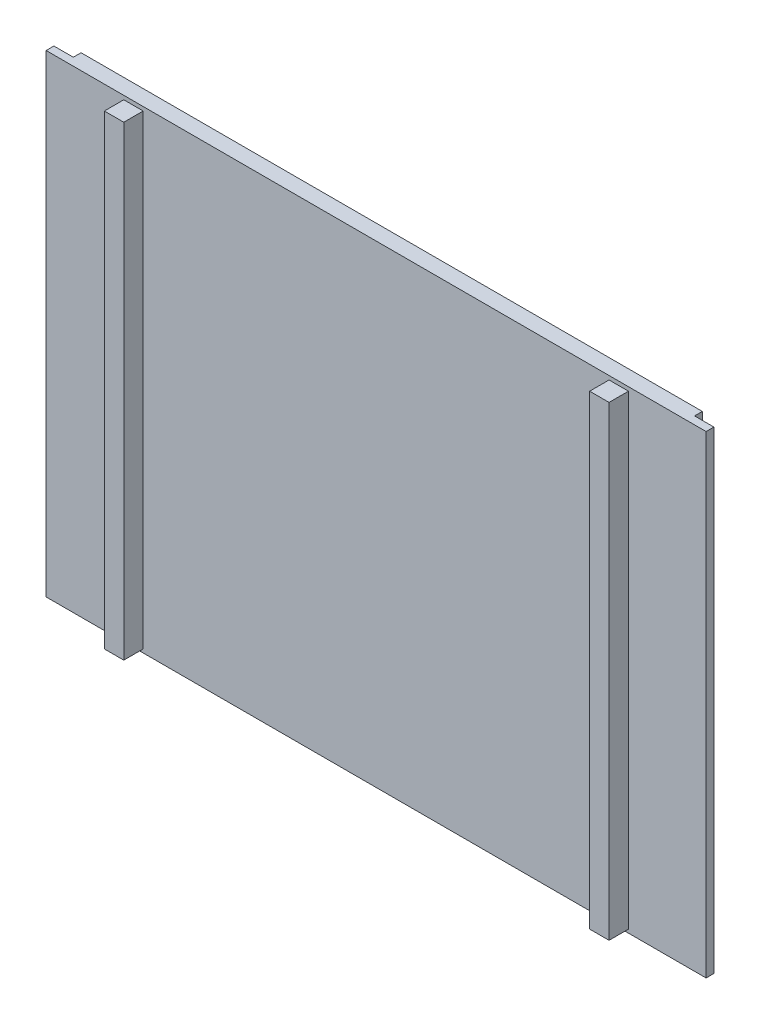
ISO-10303-21;
HEADER;
FILE_DESCRIPTION(('STEP AP214'),'2;1');
FILE_NAME('part.step','',(''),(''),'','','');
FILE_SCHEMA(('AUTOMOTIVE_DESIGN { 1 0 10303 214 1 1 1 1 }'));
ENDSEC;
DATA;
#1=APPLICATION_CONTEXT('core data for automotive mechanical design processes');
#2=APPLICATION_PROTOCOL_DEFINITION('international standard','automotive_design',2000,#1);
#3=PRODUCT_CONTEXT('',#1,'mechanical');
#4=PRODUCT('Part','Part','',(#3));
#5=PRODUCT_RELATED_PRODUCT_CATEGORY('part','',(#4));
#6=PRODUCT_DEFINITION_FORMATION('','',#4);
#7=PRODUCT_DEFINITION_CONTEXT('part definition',#1,'design');
#8=PRODUCT_DEFINITION('design','',#6,#7);
#9=PRODUCT_DEFINITION_SHAPE('','',#8);
#10=(LENGTH_UNIT() NAMED_UNIT(*) SI_UNIT(.MILLI.,.METRE.));
#11=(NAMED_UNIT(*) PLANE_ANGLE_UNIT() SI_UNIT($,.RADIAN.));
#12=(NAMED_UNIT(*) SI_UNIT($,.STERADIAN.) SOLID_ANGLE_UNIT());
#13=UNCERTAINTY_MEASURE_WITH_UNIT(LENGTH_MEASURE(1.E-05),#10,'distance_accuracy_value','');
#14=(GEOMETRIC_REPRESENTATION_CONTEXT(3) GLOBAL_UNCERTAINTY_ASSIGNED_CONTEXT((#13)) GLOBAL_UNIT_ASSIGNED_CONTEXT((#10,
#11,#12)) REPRESENTATION_CONTEXT('',''));
#15=CARTESIAN_POINT('',(0.,0.,0.));
#16=DIRECTION('',(0.,0.,1.));
#17=DIRECTION('',(1.,0.,0.));
#18=AXIS2_PLACEMENT_3D('',#15,#16,#17);
#19=CARTESIAN_POINT('',(0.,0.,10.));
#20=DIRECTION('',(0.,0.,-1.));
#21=DIRECTION('',(-1.,0.,0.));
#22=AXIS2_PLACEMENT_3D('',#19,#20,#21);
#23=PLANE('',#22);
#24=DIRECTION('',(0.,-1.,0.));
#25=VECTOR('',#24,1.);
#26=CARTESIAN_POINT('',(100.,604.5,10.));
#27=LINE('',#26,#25);
#28=CARTESIAN_POINT('',(100.,604.5,10.));
#29=VERTEX_POINT('',#28);
#30=CARTESIAN_POINT('',(100.,4.50000000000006,10.));
#31=VERTEX_POINT('',#30);
#32=EDGE_CURVE('E201',#29,#31,#27,.T.);
#33=ORIENTED_EDGE('',*,*,#32,.F.);
#34=DIRECTION('',(-1.,0.,0.));
#35=VECTOR('',#34,1.);
#36=CARTESIAN_POINT('',(100.,604.5,10.));
#37=LINE('',#36,#35);
#38=CARTESIAN_POINT('',(125.,604.5,10.));
#39=VERTEX_POINT('',#38);
#40=EDGE_CURVE('E217',#39,#29,#37,.T.);
#41=ORIENTED_EDGE('',*,*,#40,.F.);
#42=DIRECTION('',(0.,1.,0.));
#43=VECTOR('',#42,1.);
#44=CARTESIAN_POINT('',(125.,604.5,10.));
#45=LINE('',#44,#43);
#46=CARTESIAN_POINT('',(125.,4.50000000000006,10.));
#47=VERTEX_POINT('',#46);
#48=EDGE_CURVE('E230',#47,#39,#45,.T.);
#49=ORIENTED_EDGE('',*,*,#48,.F.);
#50=DIRECTION('',(1.,0.,0.));
#51=VECTOR('',#50,1.);
#52=CARTESIAN_POINT('',(100.,4.50000000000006,10.));
#53=LINE('',#52,#51);
#54=EDGE_CURVE('E206',#31,#47,#53,.T.);
#55=ORIENTED_EDGE('',*,*,#54,.F.);
#56=EDGE_LOOP('',(#33,#41,#49,#55));
#57=FACE_BOUND('',#56,.T.);
#58=DIRECTION('',(0.,-1.,0.));
#59=VECTOR('',#58,1.);
#60=CARTESIAN_POINT('',(0.,0.,10.));
#61=LINE('',#60,#59);
#62=CARTESIAN_POINT('',(0.,609.5,10.));
#63=VERTEX_POINT('',#62);
#64=CARTESIAN_POINT('',(0.,0.,10.));
#65=VERTEX_POINT('',#64);
#66=EDGE_CURVE('E338',#63,#65,#61,.T.);
#67=ORIENTED_EDGE('',*,*,#66,.T.);
#68=DIRECTION('',(1.,0.,0.));
#69=VECTOR('',#68,1.);
#70=CARTESIAN_POINT('',(0.,0.,10.));
#71=LINE('',#70,#69);
#72=CARTESIAN_POINT('',(850.,0.,10.));
#73=VERTEX_POINT('',#72);
#74=EDGE_CURVE('E342',#65,#73,#71,.T.);
#75=ORIENTED_EDGE('',*,*,#74,.T.);
#76=DIRECTION('',(0.,1.,0.));
#77=VECTOR('',#76,1.);
#78=CARTESIAN_POINT('',(850.,0.,10.));
#79=LINE('',#78,#77);
#80=CARTESIAN_POINT('',(850.,609.5,10.));
#81=VERTEX_POINT('',#80);
#82=EDGE_CURVE('E346',#73,#81,#79,.T.);
#83=ORIENTED_EDGE('',*,*,#82,.T.);
#84=DIRECTION('',(-1.,0.,0.));
#85=VECTOR('',#84,1.);
#86=CARTESIAN_POINT('',(0.,609.5,10.));
#87=LINE('',#86,#85);
#88=EDGE_CURVE('E349',#81,#63,#87,.T.);
#89=ORIENTED_EDGE('',*,*,#88,.T.);
#90=EDGE_LOOP('',(#67,#75,#83,#89));
#91=FACE_BOUND('',#90,.T.);
#92=DIRECTION('',(0.,-1.,0.));
#93=VECTOR('',#92,1.);
#94=CARTESIAN_POINT('',(725.,604.5,10.));
#95=LINE('',#94,#93);
#96=CARTESIAN_POINT('',(725.,604.5,10.));
#97=VERTEX_POINT('',#96);
#98=CARTESIAN_POINT('',(725.,4.50000000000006,10.));
#99=VERTEX_POINT('',#98);
#100=EDGE_CURVE('E199',#97,#99,#95,.T.);
#101=ORIENTED_EDGE('',*,*,#100,.F.);
#102=DIRECTION('',(-1.,0.,0.));
#103=VECTOR('',#102,1.);
#104=CARTESIAN_POINT('',(725.,604.5,10.));
#105=LINE('',#104,#103);
#106=CARTESIAN_POINT('',(750.,604.5,10.));
#107=VERTEX_POINT('',#106);
#108=EDGE_CURVE('E196',#107,#97,#105,.T.);
#109=ORIENTED_EDGE('',*,*,#108,.F.);
#110=DIRECTION('',(0.,1.,0.));
#111=VECTOR('',#110,1.);
#112=CARTESIAN_POINT('',(750.,604.5,10.));
#113=LINE('',#112,#111);
#114=CARTESIAN_POINT('',(750.,4.50000000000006,10.));
#115=VERTEX_POINT('',#114);
#116=EDGE_CURVE('E60',#115,#107,#113,.T.);
#117=ORIENTED_EDGE('',*,*,#116,.F.);
#118=DIRECTION('',(1.,0.,0.));
#119=VECTOR('',#118,1.);
#120=CARTESIAN_POINT('',(725.,4.50000000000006,10.));
#121=LINE('',#120,#119);
#122=EDGE_CURVE('E55',#99,#115,#121,.T.);
#123=ORIENTED_EDGE('',*,*,#122,.F.);
#124=EDGE_LOOP('',(#101,#109,#117,#123));
#125=FACE_BOUND('',#124,.T.);
#126=ADVANCED_FACE('F39',(#57,#91,#125),#23,.F.);
#127=CARTESIAN_POINT('',(0.,0.,10.));
#128=DIRECTION('',(1.,0.,0.));
#129=DIRECTION('',(0.,0.,-1.));
#130=AXIS2_PLACEMENT_3D('',#127,#128,#129);
#131=PLANE('',#130);
#132=DIRECTION('',(0.,-1.,0.));
#133=VECTOR('',#132,1.);
#134=CARTESIAN_POINT('',(0.,0.,0.));
#135=LINE('',#134,#133);
#136=CARTESIAN_POINT('',(0.,609.5,0.));
#137=VERTEX_POINT('',#136);
#138=CARTESIAN_POINT('',(0.,0.,0.));
#139=VERTEX_POINT('',#138);
#140=EDGE_CURVE('E337',#137,#139,#135,.T.);
#141=ORIENTED_EDGE('',*,*,#140,.T.);
#142=DIRECTION('',(0.,0.,-1.));
#143=VECTOR('',#142,1.);
#144=CARTESIAN_POINT('',(0.,0.,10.));
#145=LINE('',#144,#143);
#146=EDGE_CURVE('E11',#65,#139,#145,.T.);
#147=ORIENTED_EDGE('',*,*,#146,.F.);
#148=ORIENTED_EDGE('',*,*,#66,.F.);
#149=DIRECTION('',(0.,0.,-1.));
#150=VECTOR('',#149,1.);
#151=CARTESIAN_POINT('',(0.,609.5,10.));
#152=LINE('',#151,#150);
#153=EDGE_CURVE('E352',#63,#137,#152,.T.);
#154=ORIENTED_EDGE('',*,*,#153,.T.);
#155=EDGE_LOOP('',(#141,#147,#148,#154));
#156=FACE_BOUND('',#155,.T.);
#157=ADVANCED_FACE('F41',(#156),#131,.F.);
#158=CARTESIAN_POINT('',(0.,0.,10.));
#159=DIRECTION('',(0.,1.,0.));
#160=DIRECTION('',(0.,0.,1.));
#161=AXIS2_PLACEMENT_3D('',#158,#159,#160);
#162=PLANE('',#161);
#163=DIRECTION('',(1.,0.,0.));
#164=VECTOR('',#163,1.);
#165=CARTESIAN_POINT('',(0.,0.,0.));
#166=LINE('',#165,#164);
#167=CARTESIAN_POINT('',(850.,0.,0.));
#168=VERTEX_POINT('',#167);
#169=EDGE_CURVE('E356',#139,#168,#166,.T.);
#170=ORIENTED_EDGE('',*,*,#169,.T.);
#171=DIRECTION('',(0.,0.,-1.));
#172=VECTOR('',#171,1.);
#173=CARTESIAN_POINT('',(850.,0.,10.));
#174=LINE('',#173,#172);
#175=EDGE_CURVE('E48',#73,#168,#174,.T.);
#176=ORIENTED_EDGE('',*,*,#175,.F.);
#177=ORIENTED_EDGE('',*,*,#74,.F.);
#178=ORIENTED_EDGE('',*,*,#146,.T.);
#179=EDGE_LOOP('',(#170,#176,#177,#178));
#180=FACE_BOUND('',#179,.T.);
#181=ADVANCED_FACE('F420',(#180),#162,.F.);
#182=CARTESIAN_POINT('',(850.,0.,10.));
#183=DIRECTION('',(-1.,0.,0.));
#184=DIRECTION('',(0.,0.,1.));
#185=AXIS2_PLACEMENT_3D('',#182,#183,#184);
#186=PLANE('',#185);
#187=DIRECTION('',(0.,1.,0.));
#188=VECTOR('',#187,1.);
#189=CARTESIAN_POINT('',(850.,0.,0.));
#190=LINE('',#189,#188);
#191=CARTESIAN_POINT('',(850.,609.5,0.));
#192=VERTEX_POINT('',#191);
#193=EDGE_CURVE('E359',#168,#192,#190,.T.);
#194=ORIENTED_EDGE('',*,*,#193,.T.);
#195=DIRECTION('',(0.,0.,-1.));
#196=VECTOR('',#195,1.);
#197=CARTESIAN_POINT('',(850.,609.5,10.));
#198=LINE('',#197,#196);
#199=EDGE_CURVE('E369',#81,#192,#198,.T.);
#200=ORIENTED_EDGE('',*,*,#199,.F.);
#201=ORIENTED_EDGE('',*,*,#82,.F.);
#202=ORIENTED_EDGE('',*,*,#175,.T.);
#203=EDGE_LOOP('',(#194,#200,#201,#202));
#204=FACE_BOUND('',#203,.T.);
#205=ADVANCED_FACE('F378',(#204),#186,.F.);
#206=CARTESIAN_POINT('',(0.,609.5,10.));
#207=DIRECTION('',(0.,-1.,0.));
#208=DIRECTION('',(0.,0.,-1.));
#209=AXIS2_PLACEMENT_3D('',#206,#207,#208);
#210=PLANE('',#209);
#211=DIRECTION('',(-1.,0.,0.));
#212=VECTOR('',#211,1.);
#213=CARTESIAN_POINT('',(0.,609.5,0.));
#214=LINE('',#213,#212);
#215=CARTESIAN_POINT('',(825.16,609.5,0.));
#216=VERTEX_POINT('',#215);
#217=EDGE_CURVE('E343',#192,#216,#214,.T.);
#218=ORIENTED_EDGE('',*,*,#217,.T.);
#219=DIRECTION('',(0.,0.,1.));
#220=VECTOR('',#219,1.);
#221=CARTESIAN_POINT('',(825.16,609.5,-10.));
#222=LINE('',#221,#220);
#223=CARTESIAN_POINT('',(825.16,609.5,-10.));
#224=VERTEX_POINT('',#223);
#225=EDGE_CURVE('E311',#224,#216,#222,.T.);
#226=ORIENTED_EDGE('',*,*,#225,.F.);
#227=DIRECTION('',(1.,0.,0.));
#228=VECTOR('',#227,1.);
#229=CARTESIAN_POINT('',(825.16,609.5,-10.));
#230=LINE('',#229,#228);
#231=CARTESIAN_POINT('',(25.,609.5,-10.));
#232=VERTEX_POINT('',#231);
#233=EDGE_CURVE('E308',#232,#224,#230,.T.);
#234=ORIENTED_EDGE('',*,*,#233,.F.);
#235=DIRECTION('',(0.,0.,1.));
#236=VECTOR('',#235,1.);
#237=CARTESIAN_POINT('',(25.,609.5,-10.));
#238=LINE('',#237,#236);
#239=CARTESIAN_POINT('',(25.,609.5,0.));
#240=VERTEX_POINT('',#239);
#241=EDGE_CURVE('E325',#232,#240,#238,.T.);
#242=ORIENTED_EDGE('',*,*,#241,.T.);
#243=EDGE_CURVE('E362',#240,#137,#214,.T.);
#244=ORIENTED_EDGE('',*,*,#243,.T.);
#245=ORIENTED_EDGE('',*,*,#153,.F.);
#246=ORIENTED_EDGE('',*,*,#88,.F.);
#247=ORIENTED_EDGE('',*,*,#199,.T.);
#248=EDGE_LOOP('',(#218,#226,#234,#242,#244,#245,#246,#247));
#249=FACE_BOUND('',#248,.T.);
#250=ADVANCED_FACE('F387',(#249),#210,.F.);
#251=CARTESIAN_POINT('',(0.,0.,0.));
#252=DIRECTION('',(0.,0.,-1.));
#253=DIRECTION('',(-1.,0.,0.));
#254=AXIS2_PLACEMENT_3D('',#251,#252,#253);
#255=PLANE('',#254);
#256=DIRECTION('',(0.,-1.,0.));
#257=VECTOR('',#256,1.);
#258=CARTESIAN_POINT('',(825.16,4.99000000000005,0.));
#259=LINE('',#258,#257);
#260=CARTESIAN_POINT('',(825.16,4.99000000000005,0.));
#261=VERTEX_POINT('',#260);
#262=EDGE_CURVE('E296',#216,#261,#259,.T.);
#263=ORIENTED_EDGE('',*,*,#262,.F.);
#264=ORIENTED_EDGE('',*,*,#217,.F.);
#265=ORIENTED_EDGE('',*,*,#193,.F.);
#266=ORIENTED_EDGE('',*,*,#169,.F.);
#267=ORIENTED_EDGE('',*,*,#140,.F.);
#268=ORIENTED_EDGE('',*,*,#243,.F.);
#269=DIRECTION('',(0.,1.,0.));
#270=VECTOR('',#269,1.);
#271=CARTESIAN_POINT('',(25.,4.99000000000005,0.));
#272=LINE('',#271,#270);
#273=CARTESIAN_POINT('',(25.,4.99000000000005,0.));
#274=VERTEX_POINT('',#273);
#275=EDGE_CURVE('E302',#274,#240,#272,.T.);
#276=ORIENTED_EDGE('',*,*,#275,.F.);
#277=DIRECTION('',(-1.,0.,0.));
#278=VECTOR('',#277,1.);
#279=CARTESIAN_POINT('',(825.16,4.99000000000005,0.));
#280=LINE('',#279,#278);
#281=EDGE_CURVE('E315',#261,#274,#280,.T.);
#282=ORIENTED_EDGE('',*,*,#281,.F.);
#283=EDGE_LOOP('',(#263,#264,#265,#266,#267,#268,#276,#282));
#284=FACE_BOUND('',#283,.T.);
#285=ADVANCED_FACE('F383',(#284),#255,.T.);
#286=CARTESIAN_POINT('',(0.,0.,-10.));
#287=DIRECTION('',(0.,0.,1.));
#288=DIRECTION('',(1.,0.,0.));
#289=AXIS2_PLACEMENT_3D('',#286,#287,#288);
#290=PLANE('',#289);
#291=DIRECTION('',(0.,-1.,0.));
#292=VECTOR('',#291,1.);
#293=CARTESIAN_POINT('',(825.16,4.99000000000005,-10.));
#294=LINE('',#293,#292);
#295=CARTESIAN_POINT('',(825.16,4.99000000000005,-10.));
#296=VERTEX_POINT('',#295);
#297=EDGE_CURVE('E297',#224,#296,#294,.T.);
#298=ORIENTED_EDGE('',*,*,#297,.T.);
#299=DIRECTION('',(-1.,0.,0.));
#300=VECTOR('',#299,1.);
#301=CARTESIAN_POINT('',(825.16,4.99000000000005,-10.));
#302=LINE('',#301,#300);
#303=CARTESIAN_POINT('',(25.,4.99000000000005,-10.));
#304=VERTEX_POINT('',#303);
#305=EDGE_CURVE('E301',#296,#304,#302,.T.);
#306=ORIENTED_EDGE('',*,*,#305,.T.);
#307=DIRECTION('',(0.,1.,0.));
#308=VECTOR('',#307,1.);
#309=CARTESIAN_POINT('',(25.,4.99000000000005,-10.));
#310=LINE('',#309,#308);
#311=EDGE_CURVE('E305',#304,#232,#310,.T.);
#312=ORIENTED_EDGE('',*,*,#311,.T.);
#313=ORIENTED_EDGE('',*,*,#233,.T.);
#314=EDGE_LOOP('',(#298,#306,#312,#313));
#315=FACE_BOUND('',#314,.T.);
#316=DIRECTION('',(0.,-1.,0.));
#317=VECTOR('',#316,1.);
#318=CARTESIAN_POINT('',(820.16,9.99000000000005,-10.));
#319=LINE('',#318,#317);
#320=CARTESIAN_POINT('',(820.16,604.5,-10.));
#321=VERTEX_POINT('',#320);
#322=CARTESIAN_POINT('',(820.16,9.99000000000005,-10.));
#323=VERTEX_POINT('',#322);
#324=EDGE_CURVE('E253',#321,#323,#319,.T.);
#325=ORIENTED_EDGE('',*,*,#324,.F.);
#326=DIRECTION('',(1.,0.,0.));
#327=VECTOR('',#326,1.);
#328=CARTESIAN_POINT('',(820.16,604.5,-10.));
#329=LINE('',#328,#327);
#330=CARTESIAN_POINT('',(30.,604.5,-10.));
#331=VERTEX_POINT('',#330);
#332=EDGE_CURVE('E264',#331,#321,#329,.T.);
#333=ORIENTED_EDGE('',*,*,#332,.F.);
#334=DIRECTION('',(0.,1.,0.));
#335=VECTOR('',#334,1.);
#336=CARTESIAN_POINT('',(30.,9.99000000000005,-10.));
#337=LINE('',#336,#335);
#338=CARTESIAN_POINT('',(30.,9.99000000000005,-10.));
#339=VERTEX_POINT('',#338);
#340=EDGE_CURVE('E260',#339,#331,#337,.T.);
#341=ORIENTED_EDGE('',*,*,#340,.F.);
#342=DIRECTION('',(-1.,0.,0.));
#343=VECTOR('',#342,1.);
#344=CARTESIAN_POINT('',(820.16,9.99000000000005,-10.));
#345=LINE('',#344,#343);
#346=EDGE_CURVE('E256',#323,#339,#345,.T.);
#347=ORIENTED_EDGE('',*,*,#346,.F.);
#348=EDGE_LOOP('',(#325,#333,#341,#347));
#349=FACE_BOUND('',#348,.T.);
#350=ADVANCED_FACE('F395',(#315,#349),#290,.F.);
#351=CARTESIAN_POINT('',(825.16,4.99000000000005,-10.));
#352=DIRECTION('',(-1.,0.,0.));
#353=DIRECTION('',(0.,0.,1.));
#354=AXIS2_PLACEMENT_3D('',#351,#352,#353);
#355=PLANE('',#354);
#356=ORIENTED_EDGE('',*,*,#262,.T.);
#357=DIRECTION('',(0.,0.,1.));
#358=VECTOR('',#357,1.);
#359=CARTESIAN_POINT('',(825.16,4.99000000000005,-10.));
#360=LINE('',#359,#358);
#361=EDGE_CURVE('E333',#296,#261,#360,.T.);
#362=ORIENTED_EDGE('',*,*,#361,.F.);
#363=ORIENTED_EDGE('',*,*,#297,.F.);
#364=ORIENTED_EDGE('',*,*,#225,.T.);
#365=EDGE_LOOP('',(#356,#362,#363,#364));
#366=FACE_BOUND('',#365,.T.);
#367=ADVANCED_FACE('F392',(#366),#355,.F.);
#368=CARTESIAN_POINT('',(825.16,4.99000000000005,-10.));
#369=DIRECTION('',(0.,1.,0.));
#370=DIRECTION('',(0.,0.,1.));
#371=AXIS2_PLACEMENT_3D('',#368,#369,#370);
#372=PLANE('',#371);
#373=ORIENTED_EDGE('',*,*,#281,.T.);
#374=DIRECTION('',(0.,0.,1.));
#375=VECTOR('',#374,1.);
#376=CARTESIAN_POINT('',(25.,4.99000000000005,-10.));
#377=LINE('',#376,#375);
#378=EDGE_CURVE('E329',#304,#274,#377,.T.);
#379=ORIENTED_EDGE('',*,*,#378,.F.);
#380=ORIENTED_EDGE('',*,*,#305,.F.);
#381=ORIENTED_EDGE('',*,*,#361,.T.);
#382=EDGE_LOOP('',(#373,#379,#380,#381));
#383=FACE_BOUND('',#382,.T.);
#384=ADVANCED_FACE('F404',(#383),#372,.F.);
#385=CARTESIAN_POINT('',(25.,4.99000000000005,-10.));
#386=DIRECTION('',(1.,0.,0.));
#387=DIRECTION('',(0.,1.,0.));
#388=AXIS2_PLACEMENT_3D('',#385,#386,#387);
#389=PLANE('',#388);
#390=ORIENTED_EDGE('',*,*,#275,.T.);
#391=ORIENTED_EDGE('',*,*,#241,.F.);
#392=ORIENTED_EDGE('',*,*,#311,.F.);
#393=ORIENTED_EDGE('',*,*,#378,.T.);
#394=EDGE_LOOP('',(#390,#391,#392,#393));
#395=FACE_BOUND('',#394,.T.);
#396=ADVANCED_FACE('F402',(#395),#389,.F.);
#397=CARTESIAN_POINT('',(820.16,9.99000000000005,-10.));
#398=DIRECTION('',(-1.,0.,0.));
#399=DIRECTION('',(0.,0.,1.));
#400=AXIS2_PLACEMENT_3D('',#397,#398,#399);
#401=PLANE('',#400);
#402=DIRECTION('',(0.,-1.,0.));
#403=VECTOR('',#402,1.);
#404=CARTESIAN_POINT('',(820.16,9.99000000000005,0.));
#405=LINE('',#404,#403);
#406=CARTESIAN_POINT('',(820.16,604.5,0.));
#407=VERTEX_POINT('',#406);
#408=CARTESIAN_POINT('',(820.16,9.99000000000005,0.));
#409=VERTEX_POINT('',#408);
#410=EDGE_CURVE('E252',#407,#409,#405,.T.);
#411=ORIENTED_EDGE('',*,*,#410,.F.);
#412=DIRECTION('',(0.,0.,1.));
#413=VECTOR('',#412,1.);
#414=CARTESIAN_POINT('',(820.16,604.5,-10.));
#415=LINE('',#414,#413);
#416=EDGE_CURVE('E267',#321,#407,#415,.T.);
#417=ORIENTED_EDGE('',*,*,#416,.F.);
#418=ORIENTED_EDGE('',*,*,#324,.T.);
#419=DIRECTION('',(0.,0.,1.));
#420=VECTOR('',#419,1.);
#421=CARTESIAN_POINT('',(820.16,9.99000000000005,-10.));
#422=LINE('',#421,#420);
#423=EDGE_CURVE('E292',#323,#409,#422,.T.);
#424=ORIENTED_EDGE('',*,*,#423,.T.);
#425=EDGE_LOOP('',(#411,#417,#418,#424));
#426=FACE_BOUND('',#425,.T.);
#427=ADVANCED_FACE('F411',(#426),#401,.T.);
#428=CARTESIAN_POINT('',(820.16,9.99000000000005,-10.));
#429=DIRECTION('',(0.,1.,0.));
#430=DIRECTION('',(0.,0.,1.));
#431=AXIS2_PLACEMENT_3D('',#428,#429,#430);
#432=PLANE('',#431);
#433=DIRECTION('',(-1.,0.,0.));
#434=VECTOR('',#433,1.);
#435=CARTESIAN_POINT('',(820.16,9.99000000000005,0.));
#436=LINE('',#435,#434);
#437=CARTESIAN_POINT('',(30.,9.99000000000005,0.));
#438=VERTEX_POINT('',#437);
#439=EDGE_CURVE('E271',#409,#438,#436,.T.);
#440=ORIENTED_EDGE('',*,*,#439,.F.);
#441=ORIENTED_EDGE('',*,*,#423,.F.);
#442=ORIENTED_EDGE('',*,*,#346,.T.);
#443=DIRECTION('',(0.,0.,1.));
#444=VECTOR('',#443,1.);
#445=CARTESIAN_POINT('',(30.,9.99000000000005,-10.));
#446=LINE('',#445,#444);
#447=EDGE_CURVE('E289',#339,#438,#446,.T.);
#448=ORIENTED_EDGE('',*,*,#447,.T.);
#449=EDGE_LOOP('',(#440,#441,#442,#448));
#450=FACE_BOUND('',#449,.T.);
#451=ADVANCED_FACE('F497',(#450),#432,.T.);
#452=CARTESIAN_POINT('',(30.,9.99000000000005,-10.));
#453=DIRECTION('',(1.,0.,0.));
#454=DIRECTION('',(0.,0.,-1.));
#455=AXIS2_PLACEMENT_3D('',#452,#453,#454);
#456=PLANE('',#455);
#457=DIRECTION('',(0.,1.,0.));
#458=VECTOR('',#457,1.);
#459=CARTESIAN_POINT('',(30.,9.99000000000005,0.));
#460=LINE('',#459,#458);
#461=CARTESIAN_POINT('',(30.,604.5,0.));
#462=VERTEX_POINT('',#461);
#463=EDGE_CURVE('E275',#438,#462,#460,.T.);
#464=ORIENTED_EDGE('',*,*,#463,.F.);
#465=ORIENTED_EDGE('',*,*,#447,.F.);
#466=ORIENTED_EDGE('',*,*,#340,.T.);
#467=DIRECTION('',(0.,0.,1.));
#468=VECTOR('',#467,1.);
#469=CARTESIAN_POINT('',(30.,604.5,-10.));
#470=LINE('',#469,#468);
#471=EDGE_CURVE('E285',#331,#462,#470,.T.);
#472=ORIENTED_EDGE('',*,*,#471,.T.);
#473=EDGE_LOOP('',(#464,#465,#466,#472));
#474=FACE_BOUND('',#473,.T.);
#475=ADVANCED_FACE('F493',(#474),#456,.T.);
#476=CARTESIAN_POINT('',(820.16,604.5,-10.));
#477=DIRECTION('',(0.,-1.,0.));
#478=DIRECTION('',(0.,0.,-1.));
#479=AXIS2_PLACEMENT_3D('',#476,#477,#478);
#480=PLANE('',#479);
#481=DIRECTION('',(1.,0.,0.));
#482=VECTOR('',#481,1.);
#483=CARTESIAN_POINT('',(820.16,604.5,0.));
#484=LINE('',#483,#482);
#485=EDGE_CURVE('E257',#462,#407,#484,.T.);
#486=ORIENTED_EDGE('',*,*,#485,.F.);
#487=ORIENTED_EDGE('',*,*,#471,.F.);
#488=ORIENTED_EDGE('',*,*,#332,.T.);
#489=ORIENTED_EDGE('',*,*,#416,.T.);
#490=EDGE_LOOP('',(#486,#487,#488,#489));
#491=FACE_BOUND('',#490,.T.);
#492=ADVANCED_FACE('F490',(#491),#480,.T.);
#493=ORIENTED_EDGE('',*,*,#463,.T.);
#494=ORIENTED_EDGE('',*,*,#485,.T.);
#495=ORIENTED_EDGE('',*,*,#410,.T.);
#496=ORIENTED_EDGE('',*,*,#439,.T.);
#497=EDGE_LOOP('',(#493,#494,#495,#496));
#498=FACE_BOUND('',#497,.T.);
#499=ADVANCED_FACE('F426',(#498),#255,.T.);
#500=CARTESIAN_POINT('',(100.,604.5,35.));
#501=DIRECTION('',(1.,0.,0.));
#502=DIRECTION('',(0.,1.,0.));
#503=AXIS2_PLACEMENT_3D('',#500,#501,#502);
#504=PLANE('',#503);
#505=ORIENTED_EDGE('',*,*,#32,.T.);
#506=DIRECTION('',(0.,0.,-1.));
#507=VECTOR('',#506,1.);
#508=CARTESIAN_POINT('',(100.,4.50000000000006,35.));
#509=LINE('',#508,#507);
#510=CARTESIAN_POINT('',(100.,4.50000000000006,35.));
#511=VERTEX_POINT('',#510);
#512=EDGE_CURVE('E248',#511,#31,#509,.T.);
#513=ORIENTED_EDGE('',*,*,#512,.F.);
#514=DIRECTION('',(0.,-1.,0.));
#515=VECTOR('',#514,1.);
#516=CARTESIAN_POINT('',(100.,604.5,35.));
#517=LINE('',#516,#515);
#518=CARTESIAN_POINT('',(100.,604.5,35.));
#519=VERTEX_POINT('',#518);
#520=EDGE_CURVE('E212',#519,#511,#517,.T.);
#521=ORIENTED_EDGE('',*,*,#520,.F.);
#522=DIRECTION('',(0.,0.,-1.));
#523=VECTOR('',#522,1.);
#524=CARTESIAN_POINT('',(100.,604.5,35.));
#525=LINE('',#524,#523);
#526=EDGE_CURVE('E225',#519,#29,#525,.T.);
#527=ORIENTED_EDGE('',*,*,#526,.T.);
#528=EDGE_LOOP('',(#505,#513,#521,#527));
#529=FACE_BOUND('',#528,.T.);
#530=ADVANCED_FACE('F485',(#529),#504,.F.);
#531=CARTESIAN_POINT('',(100.,4.50000000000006,35.));
#532=DIRECTION('',(0.,1.,0.));
#533=DIRECTION('',(0.,0.,1.));
#534=AXIS2_PLACEMENT_3D('',#531,#532,#533);
#535=PLANE('',#534);
#536=ORIENTED_EDGE('',*,*,#54,.T.);
#537=DIRECTION('',(0.,0.,-1.));
#538=VECTOR('',#537,1.);
#539=CARTESIAN_POINT('',(125.,4.50000000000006,35.));
#540=LINE('',#539,#538);
#541=CARTESIAN_POINT('',(125.,4.50000000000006,35.));
#542=VERTEX_POINT('',#541);
#543=EDGE_CURVE('E244',#542,#47,#540,.T.);
#544=ORIENTED_EDGE('',*,*,#543,.F.);
#545=DIRECTION('',(1.,0.,0.));
#546=VECTOR('',#545,1.);
#547=CARTESIAN_POINT('',(100.,4.50000000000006,35.));
#548=LINE('',#547,#546);
#549=EDGE_CURVE('E216',#511,#542,#548,.T.);
#550=ORIENTED_EDGE('',*,*,#549,.F.);
#551=ORIENTED_EDGE('',*,*,#512,.T.);
#552=EDGE_LOOP('',(#536,#544,#550,#551));
#553=FACE_BOUND('',#552,.T.);
#554=ADVANCED_FACE('F481',(#553),#535,.F.);
#555=CARTESIAN_POINT('',(125.,604.5,35.));
#556=DIRECTION('',(-1.,0.,0.));
#557=DIRECTION('',(0.,-1.,0.));
#558=AXIS2_PLACEMENT_3D('',#555,#556,#557);
#559=PLANE('',#558);
#560=ORIENTED_EDGE('',*,*,#48,.T.);
#561=DIRECTION('',(0.,0.,-1.));
#562=VECTOR('',#561,1.);
#563=CARTESIAN_POINT('',(125.,604.5,35.));
#564=LINE('',#563,#562);
#565=CARTESIAN_POINT('',(125.,604.5,35.));
#566=VERTEX_POINT('',#565);
#567=EDGE_CURVE('E240',#566,#39,#564,.T.);
#568=ORIENTED_EDGE('',*,*,#567,.F.);
#569=DIRECTION('',(0.,1.,0.));
#570=VECTOR('',#569,1.);
#571=CARTESIAN_POINT('',(125.,604.5,35.));
#572=LINE('',#571,#570);
#573=EDGE_CURVE('E220',#542,#566,#572,.T.);
#574=ORIENTED_EDGE('',*,*,#573,.F.);
#575=ORIENTED_EDGE('',*,*,#543,.T.);
#576=EDGE_LOOP('',(#560,#568,#574,#575));
#577=FACE_BOUND('',#576,.T.);
#578=ADVANCED_FACE('F477',(#577),#559,.F.);
#579=CARTESIAN_POINT('',(100.,604.5,35.));
#580=DIRECTION('',(0.,-1.,0.));
#581=DIRECTION('',(1.,0.,0.));
#582=AXIS2_PLACEMENT_3D('',#579,#580,#581);
#583=PLANE('',#582);
#584=ORIENTED_EDGE('',*,*,#40,.T.);
#585=ORIENTED_EDGE('',*,*,#526,.F.);
#586=DIRECTION('',(-1.,0.,0.));
#587=VECTOR('',#586,1.);
#588=CARTESIAN_POINT('',(100.,604.5,35.));
#589=LINE('',#588,#587);
#590=EDGE_CURVE('E223',#566,#519,#589,.T.);
#591=ORIENTED_EDGE('',*,*,#590,.F.);
#592=ORIENTED_EDGE('',*,*,#567,.T.);
#593=EDGE_LOOP('',(#584,#585,#591,#592));
#594=FACE_BOUND('',#593,.T.);
#595=ADVANCED_FACE('F473',(#594),#583,.F.);
#596=CARTESIAN_POINT('',(0.,0.,35.));
#597=DIRECTION('',(0.,0.,1.));
#598=DIRECTION('',(1.,0.,0.));
#599=AXIS2_PLACEMENT_3D('',#596,#597,#598);
#600=PLANE('',#599);
#601=ORIENTED_EDGE('',*,*,#520,.T.);
#602=ORIENTED_EDGE('',*,*,#549,.T.);
#603=ORIENTED_EDGE('',*,*,#573,.T.);
#604=ORIENTED_EDGE('',*,*,#590,.T.);
#605=EDGE_LOOP('',(#601,#602,#603,#604));
#606=FACE_BOUND('',#605,.T.);
#607=ADVANCED_FACE('F470',(#606),#600,.T.);
#608=CARTESIAN_POINT('',(725.,604.5,35.));
#609=DIRECTION('',(1.,0.,0.));
#610=DIRECTION('',(0.,1.,0.));
#611=AXIS2_PLACEMENT_3D('',#608,#609,#610);
#612=PLANE('',#611);
#613=ORIENTED_EDGE('',*,*,#100,.T.);
#614=DIRECTION('',(0.,0.,-1.));
#615=VECTOR('',#614,1.);
#616=CARTESIAN_POINT('',(725.,4.50000000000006,35.));
#617=LINE('',#616,#615);
#618=CARTESIAN_POINT('',(725.,4.50000000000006,35.));
#619=VERTEX_POINT('',#618);
#620=EDGE_CURVE('E178',#619,#99,#617,.T.);
#621=ORIENTED_EDGE('',*,*,#620,.F.);
#622=DIRECTION('',(0.,-1.,0.));
#623=VECTOR('',#622,1.);
#624=CARTESIAN_POINT('',(725.,604.5,35.));
#625=LINE('',#624,#623);
#626=CARTESIAN_POINT('',(725.,604.5,35.));
#627=VERTEX_POINT('',#626);
#628=EDGE_CURVE('E186',#627,#619,#625,.T.);
#629=ORIENTED_EDGE('',*,*,#628,.F.);
#630=DIRECTION('',(0.,0.,-1.));
#631=VECTOR('',#630,1.);
#632=CARTESIAN_POINT('',(725.,604.5,35.));
#633=LINE('',#632,#631);
#634=EDGE_CURVE('E441',#627,#97,#633,.T.);
#635=ORIENTED_EDGE('',*,*,#634,.T.);
#636=EDGE_LOOP('',(#613,#621,#629,#635));
#637=FACE_BOUND('',#636,.T.);
#638=ADVANCED_FACE('F198',(#637),#612,.F.);
#639=CARTESIAN_POINT('',(725.,4.50000000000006,35.));
#640=DIRECTION('',(0.,1.,0.));
#641=DIRECTION('',(0.,0.,1.));
#642=AXIS2_PLACEMENT_3D('',#639,#640,#641);
#643=PLANE('',#642);
#644=ORIENTED_EDGE('',*,*,#122,.T.);
#645=DIRECTION('',(0.,0.,-1.));
#646=VECTOR('',#645,1.);
#647=CARTESIAN_POINT('',(750.,4.50000000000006,35.));
#648=LINE('',#647,#646);
#649=CARTESIAN_POINT('',(750.,4.50000000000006,35.));
#650=VERTEX_POINT('',#649);
#651=EDGE_CURVE('E181',#650,#115,#648,.T.);
#652=ORIENTED_EDGE('',*,*,#651,.F.);
#653=DIRECTION('',(1.,0.,0.));
#654=VECTOR('',#653,1.);
#655=CARTESIAN_POINT('',(725.,4.50000000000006,35.));
#656=LINE('',#655,#654);
#657=EDGE_CURVE('E174',#619,#650,#656,.T.);
#658=ORIENTED_EDGE('',*,*,#657,.F.);
#659=ORIENTED_EDGE('',*,*,#620,.T.);
#660=EDGE_LOOP('',(#644,#652,#658,#659));
#661=FACE_BOUND('',#660,.T.);
#662=ADVANCED_FACE('F176',(#661),#643,.F.);
#663=CARTESIAN_POINT('',(750.,604.5,35.));
#664=DIRECTION('',(-1.,0.,0.));
#665=DIRECTION('',(0.,-1.,0.));
#666=AXIS2_PLACEMENT_3D('',#663,#664,#665);
#667=PLANE('',#666);
#668=ORIENTED_EDGE('',*,*,#116,.T.);
#669=DIRECTION('',(0.,0.,-1.));
#670=VECTOR('',#669,1.);
#671=CARTESIAN_POINT('',(750.,604.5,35.));
#672=LINE('',#671,#670);
#673=CARTESIAN_POINT('',(750.,604.5,35.));
#674=VERTEX_POINT('',#673);
#675=EDGE_CURVE('E208',#674,#107,#672,.T.);
#676=ORIENTED_EDGE('',*,*,#675,.F.);
#677=DIRECTION('',(0.,1.,0.));
#678=VECTOR('',#677,1.);
#679=CARTESIAN_POINT('',(750.,604.5,35.));
#680=LINE('',#679,#678);
#681=EDGE_CURVE('E185',#650,#674,#680,.T.);
#682=ORIENTED_EDGE('',*,*,#681,.F.);
#683=ORIENTED_EDGE('',*,*,#651,.T.);
#684=EDGE_LOOP('',(#668,#676,#682,#683));
#685=FACE_BOUND('',#684,.T.);
#686=ADVANCED_FACE('F457',(#685),#667,.F.);
#687=CARTESIAN_POINT('',(725.,604.5,35.));
#688=DIRECTION('',(0.,-1.,0.));
#689=DIRECTION('',(0.,0.,-1.));
#690=AXIS2_PLACEMENT_3D('',#687,#688,#689);
#691=PLANE('',#690);
#692=ORIENTED_EDGE('',*,*,#108,.T.);
#693=ORIENTED_EDGE('',*,*,#634,.F.);
#694=DIRECTION('',(-1.,0.,0.));
#695=VECTOR('',#694,1.);
#696=CARTESIAN_POINT('',(725.,604.5,35.));
#697=LINE('',#696,#695);
#698=EDGE_CURVE('E191',#674,#627,#697,.T.);
#699=ORIENTED_EDGE('',*,*,#698,.F.);
#700=ORIENTED_EDGE('',*,*,#675,.T.);
#701=EDGE_LOOP('',(#692,#693,#699,#700));
#702=FACE_BOUND('',#701,.T.);
#703=ADVANCED_FACE('F440',(#702),#691,.F.);
#704=CARTESIAN_POINT('',(0.,0.,35.));
#705=DIRECTION('',(0.,0.,1.));
#706=DIRECTION('',(1.,0.,0.));
#707=AXIS2_PLACEMENT_3D('',#704,#705,#706);
#708=PLANE('',#707);
#709=ORIENTED_EDGE('',*,*,#628,.T.);
#710=ORIENTED_EDGE('',*,*,#657,.T.);
#711=ORIENTED_EDGE('',*,*,#681,.T.);
#712=ORIENTED_EDGE('',*,*,#698,.T.);
#713=EDGE_LOOP('',(#709,#710,#711,#712));
#714=FACE_BOUND('',#713,.T.);
#715=ADVANCED_FACE('F189',(#714),#708,.T.);
#716=CLOSED_SHELL('',(#126,#157,#181,#205,#250,#285,#350,#367,#384,#396,#427,#451,#475,#492,
#499,#530,#554,#578,#595,#607,#638,#662,#686,#703,#715));
#717=MANIFOLD_SOLID_BREP('B2',#716);
#718=ADVANCED_BREP_SHAPE_REPRESENTATION('',(#18,#717),#14);
#719=SHAPE_DEFINITION_REPRESENTATION(#9,#718);
ENDSEC;
END-ISO-10303-21;
